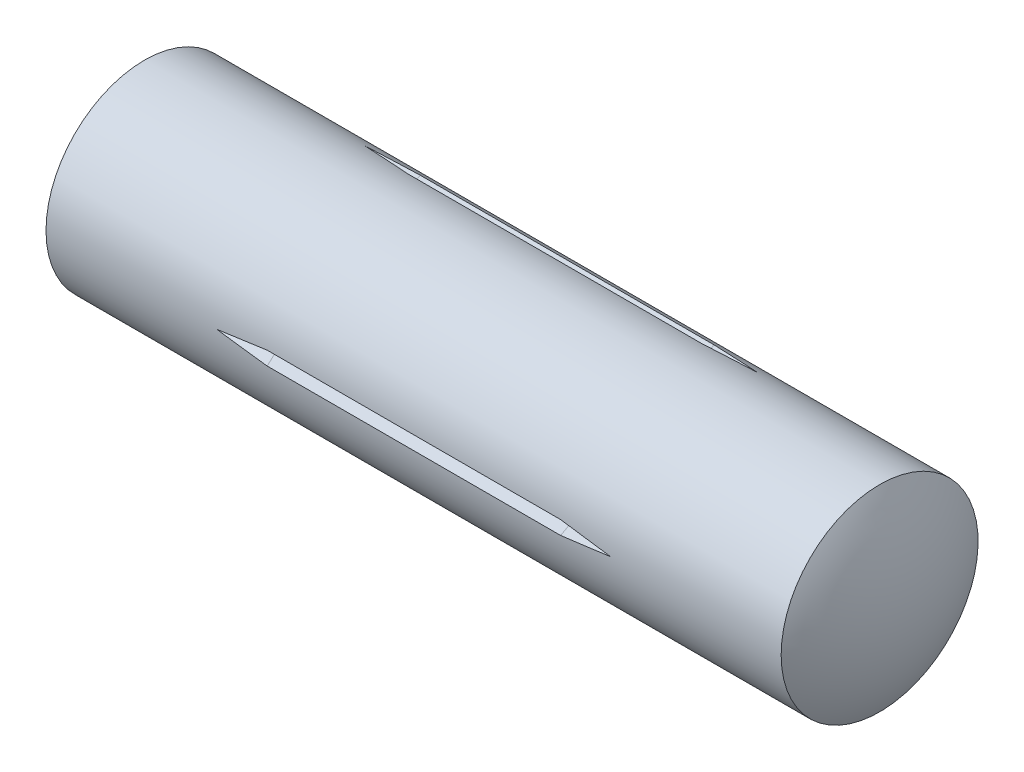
from build123d import *

# Parameters (mm, degrees)
CIRPATTERN2_COUNT = 3


with BuildPart() as part:
    # Sketch1 → Base-Revolve (revolve)
    with BuildSketch(Plane.XY):
        with BuildLine():
            Line((-50, 0), (-50, 1.25))
            ThreePointArc((-50, 1.25), (-49.010050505, 7.072345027), (-46.68190465, 12.5))
            Line((-46.68190465, 12.5), (46.650635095, 12.5))
            ThreePointArc((46.650635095, 12.5), (49.148145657, 6.470476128), (50, 0))
            Line((50, 0), (-50, 0))
        make_face()
    revolve(axis=Axis((-57, 0, 0), (1, 0, 0)))

    # Cut-Sweep3: sweep along a path in Sketch3
    with BuildLine(Plane(origin=(0, 0, 0), x_dir=(1, 0, 0), z_dir=(0, 1, 0))) as cut_sweep3_path:
        Line((-25, -12.5), (-18.75, -11.25))
        Line((-18.75, -11.25), (18.75, -11.25))
        Line((18.75, -11.25), (25, -12.5))
    # Sketch4 → Cut-Sweep3 (sweep, cut)
    with BuildSketch(Plane(origin=(-25, 0, 0), x_dir=(0, 0, -1), z_dir=(1, 0, 0))):
        Polygon((-12.5, 0), (-14.378358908, 1.315241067), (-14.378358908, -1.315241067), align=None)
    cut_sweep3 = sweep(path=cut_sweep3_path.line, transition=Transition.RIGHT, mode=Mode.SUBTRACT)

    # CirPattern2: Cut-Sweep3 ×3 about axis
    cirpattern2_axis = Axis((0, 0, 0), (1, 0, 0))
    for i in range(1, CIRPATTERN2_COUNT):
        add(cut_sweep3.rotate(cirpattern2_axis, i * 360 / CIRPATTERN2_COUNT), mode=Mode.SUBTRACT)


solid = part.part
